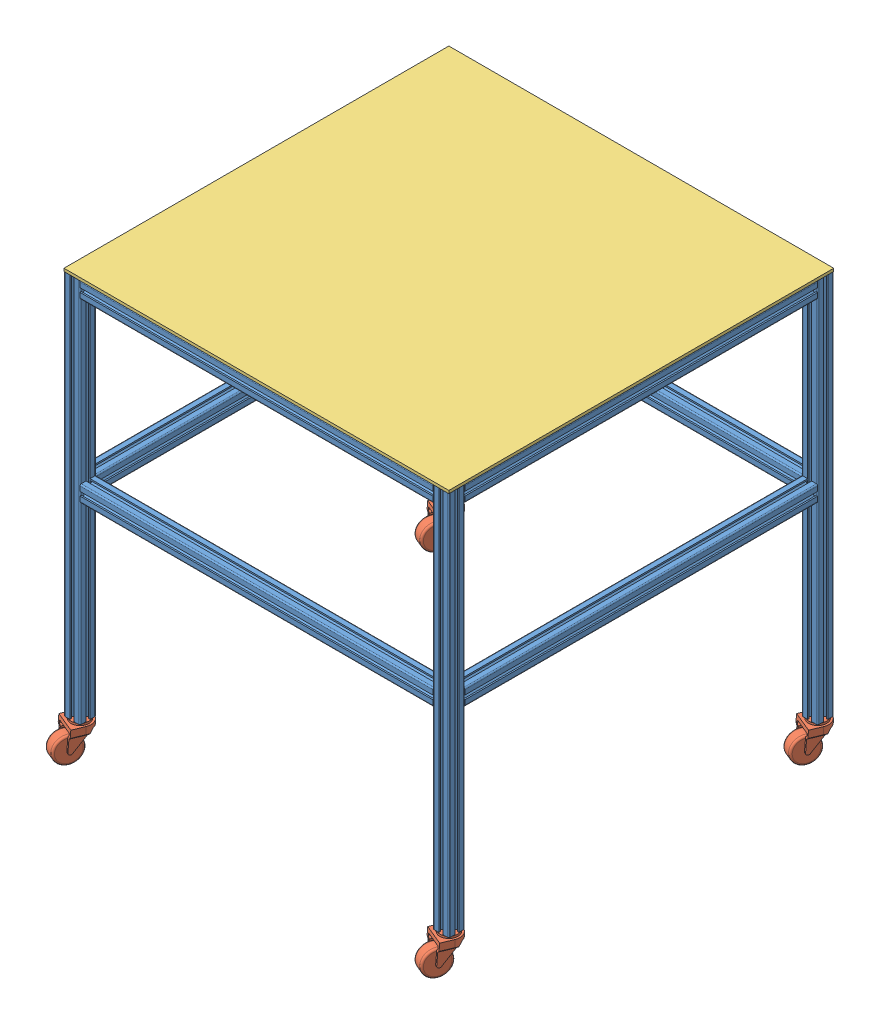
SolidWorks assembly 10-10 Table (with casters).sldasm, configuration Default (file format 4700). Lengths in mm.
Overall size (637.75 671.25 648.87).
21 component instances, 3 part files, 51 mates.
Components (placement in the parent):
- 650000-15: 650000.sldprt [24] at (-596.9 -614.0958 -12.7) x (1 0 0) z (0 -1 0) size (25.4 25.4 609.6)
- 650000-16: 650000.sldprt [22] at (-584.2 -17.1958 -12.7) x (0 1 0) z (-1 0 0) size (25.4 25.4 558.8)
- 650000-17: 650000.sldprt [24] at (-12.7 -4.4958 -12.7) x (-1 0 0) z (0 1 0) size (25.4 25.4 609.6)
- 650000-18: 650000.sldprt [22] at (-12.7 -17.1958 -25.4) x (0 1 0) z (0 0 1) size (25.4 25.4 558.8)
- 650000-19: 650000.sldprt [22] at (-596.9 -17.1958 -25.4) x (0 1 0) z (0 0 1) size (25.4 25.4 558.8)
- 650000-20: 650000.sldprt [24] at (-12.7 -4.4958 -596.9) x (0 0 1) z (0 1 0) size (25.4 25.4 609.6)
- 650000-21: 650000.sldprt [24] at (-596.9 -4.4958 -596.9) x (0 0 1) z (0 1 0) size (25.4 25.4 609.6)
- 650000-24: 650000.sldprt [22] at (-25.4 -17.1958 -596.9) x (0 0 1) z (1 0 0) size (25.4 25.4 558.8)
- 650000-25: 650000.sldprt [22] at (-584.2 -296.5958 -12.7) x (0 -1 0) z (-1 0 0) size (25.4 25.4 558.8)
- 650000-26: 650000.sldprt [22] at (-596.9 -296.5958 -25.4) size (25.4 25.4 558.8)
- 650000-27: 650000.sldprt [22] at (-25.4 -296.5958 -596.9) x (0 0 1) z (1 0 0) size (25.4 25.4 558.8)
- 650000-28: 650000.sldprt [22] at (-12.7 -296.5958 -25.4) x (-1 0 0) z (0 0 1) size (25.4 25.4 558.8)
- 655231-1: 655231.sldasm [Default] at (-12.7 -614.0958 -12.7) x (-0.923728 0 -0.383049) z (0 1 0) size (34.95 55.51 95.25)
  - 655231-1: 655231.SLDPRT [Default] at origin size (34.95 55.51 95.25)
- 655231-2: 655231.sldasm [Default] at (-596.9 -614.0958 -12.7) x (-0.923728 0 -0.383049) z (0 1 0) size (34.95 55.51 95.25)
  - 655231-1: 655231.SLDPRT [Default] at origin size (34.95 55.51 95.25)
- 655231-3: 655231.sldasm [Default] at (-12.7 -614.0958 -596.9) x (-0.923728 0 -0.383049) z (0 1 0) size (34.95 55.51 95.25)
  - 655231-1: 655231.SLDPRT [Default] at origin size (34.95 55.51 95.25)
- 655231-4: 655231.sldasm [Default] at (-596.9 -614.0958 -596.9) x (-0.923728 0 -0.383049) z (0 1 0) size (34.95 55.51 95.25)
  - 655231-1: 655231.SLDPRT [Default] at origin size (34.95 55.51 95.25)
- 655433-1: 655433.sldprt [24x24] at (-609.6 0 -609.6) x (0 -1 0) z (-1 0 0) size (4.5 609.6 609.6)
Mates (geometry in assembly coordinates):
- Coincident50: coincident anti-aligned: plane of 650000-15; plane of 650000-16 through (38.8152 -17.1958 -12.7) normal (-1 0 0)
- Coincident52: coincident aligned: plane of 650000-15; plane of 650000-16
- Coincident54: coincident anti-aligned: plane of 650000-15; plane of 650000-16
- Coincident56: coincident anti-aligned: plane of 650000-16 through (597.6152 -17.1958 -12.7) normal (1 0 0); plane of 650000-17
- Coincident59: coincident anti-aligned: plane of 650000-16; plane of 650000-17 through (610.3152 -4.4958 -12.7) normal (0 0 1)
- Coincident60: coincident aligned: plane of 650000-16 through (597.6152 -4.4958 -15.9258) normal (0 1 0); plane of 650000-17 through (620.9832 -4.4958 -23.368) normal (0 1 0)
- Coincident61: coincident anti-aligned: plane of 650000-17; plane of 650000-18 through (610.3152 -17.1958 -25.4) normal (0 0 1)
- Coincident63: coincident aligned: plane of 650000-17 through (610.3152 -4.4958 -12.7) normal (0 1 0); plane of 650000-18
- Coincident65: coincident aligned: plane of 650000-17; plane of 650000-18
- Coincident66: coincident anti-aligned: plane of 650000-15 through (26.1152 -614.0958 -25.4) normal (0 0 -1); plane of 650000-19 through (26.1152 -17.1958 -25.4) normal (0 0 1)
- Coincident68: coincident aligned: plane of 650000-15; plane of 650000-19
- Coincident70: coincident anti-aligned: plane of 650000-15; plane of 650000-19
- Coincident72: coincident anti-aligned: plane of 650000-18 through (610.3152 -17.1958 -584.2) normal (0 0 -1); plane of 650000-20
- Coincident75: coincident anti-aligned: plane of 650000-18; plane of 650000-20
- Coincident76: coincident aligned: plane of 650000-18 through (613.541 -4.4958 -584.2) normal (0 1 0); plane of 650000-20 through (599.6472 -4.4958 -607.568) normal (0 1 0)
- Coincident78: coincident anti-aligned: plane of 650000-19 through (26.1152 -17.1958 -584.2) normal (0 0 -1); plane of 650000-21
- Coincident81: coincident anti-aligned: plane of 650000-19; plane of 650000-21
- Coincident82: coincident aligned: plane of 650000-19 through (29.341 -4.4958 -584.2) normal (0 1 0); plane of 650000-21 through (15.4472 -4.4958 -607.568) normal (0 1 0)
- Coincident90: coincident anti-aligned: plane of 650000-20; plane of 650000-24 through (597.6152 -17.1958 -596.9) normal (1 0 0)
- Coincident91: coincident aligned: plane of 650000-20; plane of 650000-24
- Coincident92: coincident aligned: plane of 650000-20 through (599.6472 -4.4958 -607.568) normal (0 1 0); plane of 650000-24 through (38.8152 -4.4958 -593.6742) normal (0 1 0)
- Coincident93: coincident anti-aligned: plane of 650000-15; plane of 650000-25 through (38.8152 -296.5958 -12.7) normal (-1 0 0)
- Coincident94: coincident aligned: plane of 650000-15; plane of 650000-25
- Coincident95: coincident anti-aligned: plane of 650000-15 through (26.1152 -614.0958 -25.4) normal (0 0 -1); plane of 650000-26 through (26.1152 -296.5958 -25.4) normal (0 0 1)
- Coincident96: coincident aligned: plane of 650000-15; plane of 650000-26 through (26.1152 -296.5958 -25.4) normal (1 0 0)
- Coincident97: coincident anti-aligned: plane of 650000-20; plane of 650000-27 through (597.6152 -296.5958 -596.9) normal (1 0 0)
- Coincident98: coincident aligned: plane of 650000-20; plane of 650000-27
- Coincident99: coincident anti-aligned: plane of 650000-17; plane of 650000-28 through (610.3152 -296.5958 -25.4) normal (0 0 1)
- Coincident100: coincident aligned: plane of 650000-17; plane of 650000-28
- Distance5: distance = 304.8 mm aligned: plane of 650000-28 through (-9.4742 -309.2958 -584.2) normal (0 -1 0); plane of 650000-17 through (-2.032 -614.0958 -23.368) normal (0 -1 0)
- Distance6: distance = 304.8 mm aligned: plane of 650000-27 through (-584.2 -309.2958 -600.1258) normal (0 -1 0); plane of 650000-20 through (-23.368 -614.0958 -607.568) normal (0 -1 0)
- Distance7: distance = 304.8 mm aligned: plane of 650000-26 through (-593.6742 -309.2958 -584.2) normal (0 -1 0); plane of 650000-21 through (-607.568 -614.0958 -607.568) normal (0 -1 0)
- Distance8: distance = 304.8 mm aligned: plane of 650000-25 through (-25.4 -309.2958 -9.4742) normal (0 -1 0); plane of 650000-15 through (-607.568 -614.0958 -23.368) normal (0 -1 0)
- Coincident108: coincident anti-aligned: plane of 650000-17; plane of 655231-1 through (610.3152 -614.0958 -12.7) normal (0 1 0)
- Coincident109: coincident anti-aligned: plane of 650000-17; line of 655231-1 through (610.3152 -575.9958 -12.7) axis (0 -1 0)
- Coincident110: coincident anti-aligned: plane of 650000-17 through (610.3152 -4.4958 -12.7) normal (0 0 1); line of 655231-1 through (610.3152 -575.9958 -12.7) axis (0 -1 0)
- Coincident111: coincident anti-aligned: plane of 650000-15 through (26.1152 -614.0958 -12.7) normal (0 -1 0); plane of 655231-2 through (26.1152 -614.0958 -12.7) normal (0 1 0)
- Coincident112: coincident anti-aligned: plane of 650000-15; line of 655231-2 through (26.1152 -575.9958 -12.7) axis (0 -1 0)
- Coincident113: coincident anti-aligned: plane of 650000-15; line of 655231-2 through (26.1152 -575.9958 -12.7) axis (0 -1 0)
- Coincident114: coincident anti-aligned: plane of 650000-20; plane of 655231-3 through (610.3152 -614.0958 -596.9) normal (0 1 0)
- Coincident115: coincident anti-aligned: plane of 650000-20; line of 655231-3 through (610.3152 -575.9958 -596.9) axis (0 -1 0)
- Coincident116: coincident anti-aligned: plane of 650000-20; line of 655231-3 through (610.3152 -575.9958 -596.9) axis (0 -1 0)
- Coincident117: coincident anti-aligned: plane of 650000-21; plane of 655231-4 through (26.1152 -614.0958 -596.9) normal (0 1 0)
- Coincident118: coincident anti-aligned: plane of 650000-21; line of 655231-4 through (26.1152 -575.9958 -596.9) axis (0 -1 0)
- Coincident119: coincident anti-aligned: plane of 650000-21; line of 655231-4 through (26.1152 -575.9958 -596.9) axis (0 -1 0)
- Coincident120: coincident anti-aligned: plane of 650000-16 through (597.6152 -4.4958 -15.9258) normal (0 1 0); plane of 655433-1 through (13.4152 -4.4958 0) normal (0 -1 0)
- Coincident121: coincident aligned: plane of 650000-18 through (623.0152 -13.97 -584.2) normal (1 0 0); plane of 655433-1 through (623.0152 -4.4958 -609.6) normal (1 0 0)
- Coincident122: coincident aligned: plane of 650000-24 through (38.8152 -13.97 -609.6) normal (0 0 -1); plane of 655433-1 through (13.4152 -4.4958 -609.6) normal (0 0 -1)
- Coincident123: coincident aligned: plane of 655433-1 through (-609.6 0 0) normal (0 1 0); plane of assembly
- Coincident124: coincident aligned: plane of 650000-16 through (-25.4 -20.4216 0) normal (0 0 1); plane of assembly
- Coincident125: coincident aligned: plane of 650000-18 through (0 -20.4216 -584.2) normal (1 0 0); plane of assembly
